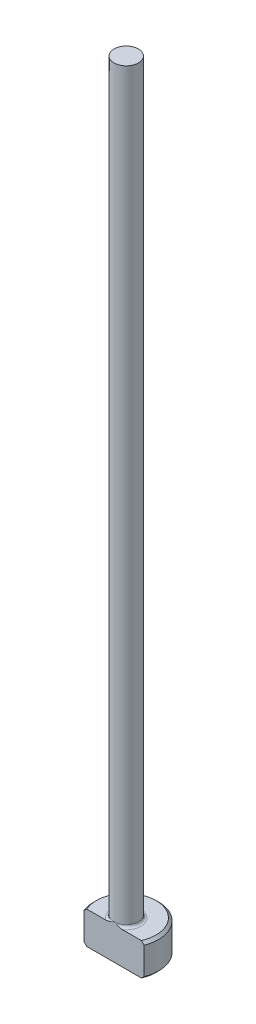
ISO-10303-21;
HEADER;
FILE_DESCRIPTION(('STEP AP214'),'2;1');
FILE_NAME('part.step','',(''),(''),'','','');
FILE_SCHEMA(('AUTOMOTIVE_DESIGN { 1 0 10303 214 1 1 1 1 }'));
ENDSEC;
DATA;
#1=APPLICATION_CONTEXT('core data for automotive mechanical design processes');
#2=APPLICATION_PROTOCOL_DEFINITION('international standard','automotive_design',2000,#1);
#3=PRODUCT_CONTEXT('',#1,'mechanical');
#4=PRODUCT('Part','Part','',(#3));
#5=PRODUCT_RELATED_PRODUCT_CATEGORY('part','',(#4));
#6=PRODUCT_DEFINITION_FORMATION('','',#4);
#7=PRODUCT_DEFINITION_CONTEXT('part definition',#1,'design');
#8=PRODUCT_DEFINITION('design','',#6,#7);
#9=PRODUCT_DEFINITION_SHAPE('','',#8);
#10=(LENGTH_UNIT() NAMED_UNIT(*) SI_UNIT(.MILLI.,.METRE.));
#11=(NAMED_UNIT(*) PLANE_ANGLE_UNIT() SI_UNIT($,.RADIAN.));
#12=(NAMED_UNIT(*) SI_UNIT($,.STERADIAN.) SOLID_ANGLE_UNIT());
#13=UNCERTAINTY_MEASURE_WITH_UNIT(LENGTH_MEASURE(1.E-05),#10,'distance_accuracy_value','');
#14=(GEOMETRIC_REPRESENTATION_CONTEXT(3) GLOBAL_UNCERTAINTY_ASSIGNED_CONTEXT((#13)) GLOBAL_UNIT_ASSIGNED_CONTEXT((#10,
#11,#12)) REPRESENTATION_CONTEXT('',''));
#15=CARTESIAN_POINT('',(0.,0.,0.));
#16=DIRECTION('',(0.,0.,1.));
#17=DIRECTION('',(1.,0.,0.));
#18=AXIS2_PLACEMENT_3D('',#15,#16,#17);
#19=CARTESIAN_POINT('',(0.,0.,0.));
#20=DIRECTION('',(0.,-1.,0.));
#21=DIRECTION('',(0.,0.,-1.));
#22=AXIS2_PLACEMENT_3D('',#19,#20,#21);
#23=PLANE('',#22);
#24=CARTESIAN_POINT('',(0.,0.,0.));
#25=DIRECTION('',(0.,-1.,0.));
#26=DIRECTION('',(0.,0.,-1.));
#27=AXIS2_PLACEMENT_3D('',#24,#25,#26);
#28=CIRCLE('',#27,2.92099999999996);
#29=CARTESIAN_POINT('',(-2.66761406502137,0.,1.18998999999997));
#30=VERTEX_POINT('',#29);
#31=CARTESIAN_POINT('',(2.66761406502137,0.,1.18998999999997));
#32=VERTEX_POINT('',#31);
#33=EDGE_CURVE('E98',#30,#32,#28,.T.);
#34=ORIENTED_EDGE('',*,*,#33,.T.);
#35=DIRECTION('',(-1.,0.,0.));
#36=VECTOR('',#35,1.);
#37=CARTESIAN_POINT('',(-2.94356056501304,0.,1.18998999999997));
#38=LINE('',#37,#36);
#39=EDGE_CURVE('E83',#32,#30,#38,.T.);
#40=ORIENTED_EDGE('',*,*,#39,.T.);
#41=EDGE_LOOP('',(#34,#40));
#42=FACE_BOUND('',#41,.T.);
#43=ADVANCED_FACE('F32',(#42),#23,.T.);
#44=CARTESIAN_POINT('',(0.,259.958771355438,0.));
#45=DIRECTION('',(0.,1.,0.));
#46=DIRECTION('',(0.,0.,1.));
#47=AXIS2_PLACEMENT_3D('',#44,#45,#46);
#48=CYLINDRICAL_SURFACE('',#47,3.17499999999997);
#49=CARTESIAN_POINT('',(0.,2.92099999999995,0.));
#50=DIRECTION('',(0.,1.,0.));
#51=DIRECTION('',(0.,0.,1.));
#52=AXIS2_PLACEMENT_3D('',#49,#50,#51);
#53=CIRCLE('',#52,3.17499999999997);
#54=CARTESIAN_POINT('',(-2.94356056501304,2.92099999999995,1.18998999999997));
#55=VERTEX_POINT('',#54);
#56=CARTESIAN_POINT('',(2.94356056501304,2.92099999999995,1.18998999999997));
#57=VERTEX_POINT('',#56);
#58=EDGE_CURVE('E104',#55,#57,#53,.F.);
#59=ORIENTED_EDGE('',*,*,#58,.T.);
#60=DIRECTION('',(0.,-1.,0.));
#61=VECTOR('',#60,1.);
#62=CARTESIAN_POINT('',(2.94356056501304,76.2,1.18998999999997));
#63=LINE('',#62,#61);
#64=CARTESIAN_POINT('',(2.94356056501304,0.254000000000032,1.18998999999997));
#65=VERTEX_POINT('',#64);
#66=EDGE_CURVE('E183',#57,#65,#63,.T.);
#67=ORIENTED_EDGE('',*,*,#66,.T.);
#68=CARTESIAN_POINT('',(0.,0.254000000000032,0.));
#69=DIRECTION('',(0.,-1.,0.));
#70=DIRECTION('',(0.,0.,-1.));
#71=AXIS2_PLACEMENT_3D('',#68,#69,#70);
#72=CIRCLE('',#71,3.17499999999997);
#73=CARTESIAN_POINT('',(-2.94356056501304,0.254000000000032,1.18998999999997));
#74=VERTEX_POINT('',#73);
#75=EDGE_CURVE('E100',#65,#74,#72,.F.);
#76=ORIENTED_EDGE('',*,*,#75,.T.);
#77=DIRECTION('',(0.,-1.,0.));
#78=VECTOR('',#77,1.);
#79=CARTESIAN_POINT('',(-2.94356056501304,76.2,1.18998999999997));
#80=LINE('',#79,#78);
#81=EDGE_CURVE('E93',#55,#74,#80,.T.);
#82=ORIENTED_EDGE('',*,*,#81,.F.);
#83=EDGE_LOOP('',(#59,#67,#76,#82));
#84=FACE_BOUND('',#83,.T.);
#85=ADVANCED_FACE('F158',(#84),#48,.T.);
#86=CARTESIAN_POINT('',(-3.17499999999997,3.175,0.));
#87=DIRECTION('',(0.,1.,0.));
#88=DIRECTION('',(0.,0.,1.));
#89=AXIS2_PLACEMENT_3D('',#86,#87,#88);
#90=PLANE('',#89);
#91=CARTESIAN_POINT('',(0.,3.175,0.));
#92=DIRECTION('',(0.,1.,0.));
#93=DIRECTION('',(0.,0.,1.));
#94=AXIS2_PLACEMENT_3D('',#91,#92,#93);
#95=CIRCLE('',#94,2.92099999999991);
#96=CARTESIAN_POINT('',(2.66761406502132,3.175,1.18998999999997));
#97=VERTEX_POINT('',#96);
#98=CARTESIAN_POINT('',(-2.66761406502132,3.175,1.18998999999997));
#99=VERTEX_POINT('',#98);
#100=EDGE_CURVE('E178',#97,#99,#95,.T.);
#101=ORIENTED_EDGE('',*,*,#100,.T.);
#102=DIRECTION('',(1.,0.,0.));
#103=VECTOR('',#102,1.);
#104=CARTESIAN_POINT('',(-3.17499999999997,3.175,1.18998999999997));
#105=LINE('',#104,#103);
#106=CARTESIAN_POINT('',(-0.817943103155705,3.17500000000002,1.18998999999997));
#107=VERTEX_POINT('',#106);
#108=EDGE_CURVE('E57',#99,#107,#105,.T.);
#109=ORIENTED_EDGE('',*,*,#108,.T.);
#110=CARTESIAN_POINT('',(0.,3.175,0.));
#111=DIRECTION('',(0.,1.,0.));
#112=DIRECTION('',(0.,0.,1.));
#113=AXIS2_PLACEMENT_3D('',#110,#111,#112);
#114=CIRCLE('',#113,1.44398999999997);
#115=CARTESIAN_POINT('',(0.817943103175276,3.17500000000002,1.18998999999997));
#116=VERTEX_POINT('',#115);
#117=EDGE_CURVE('E107',#107,#116,#114,.F.);
#118=ORIENTED_EDGE('',*,*,#117,.T.);
#119=EDGE_CURVE('E136',#116,#97,#105,.T.);
#120=ORIENTED_EDGE('',*,*,#119,.T.);
#121=EDGE_LOOP('',(#101,#109,#118,#120));
#122=FACE_BOUND('',#121,.T.);
#123=ADVANCED_FACE('F147',(#122),#90,.T.);
#124=CARTESIAN_POINT('',(0.,3.17499999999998,0.));
#125=DIRECTION('',(0.,-1.,0.));
#126=DIRECTION('',(0.,0.,-1.));
#127=AXIS2_PLACEMENT_3D('',#124,#125,#126);
#128=CONICAL_SURFACE('',#127,2.92099999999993,0.78539816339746);
#129=ORIENTED_EDGE('',*,*,#58,.F.);
#130=CARTESIAN_POINT('',(-6.47931936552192,-0.491689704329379,1.18998999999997));
#131=CARTESIAN_POINT('',(-6.3057518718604,-0.320986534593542,1.18998999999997));
#132=CARTESIAN_POINT('',(-6.13208094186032,-0.150388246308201,1.18998999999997));
#133=CARTESIAN_POINT('',(-5.78425276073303,0.190708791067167,1.18998999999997));
#134=CARTESIAN_POINT('',(-5.61009518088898,0.361207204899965,1.18998999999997));
#135=CARTESIAN_POINT('',(-5.25789988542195,0.70525365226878,1.18998999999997));
#136=CARTESIAN_POINT('',(-5.07985463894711,0.878793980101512,1.18998999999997));
#137=CARTESIAN_POINT('',(-4.72344726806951,1.22514212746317,1.18998999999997));
#138=CARTESIAN_POINT('',(-4.54508573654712,1.39795055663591,1.18998999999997));
#139=CARTESIAN_POINT('',(-4.22178053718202,1.70987820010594,1.18998999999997));
#140=CARTESIAN_POINT('',(-4.07696186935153,1.84912689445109,1.18998999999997));
#141=CARTESIAN_POINT('',(-3.78666752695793,2.1269755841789,1.18998999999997));
#142=CARTESIAN_POINT('',(-3.64119177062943,2.26557549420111,1.18998999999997));
#143=CARTESIAN_POINT('',(-3.34872942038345,2.54243487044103,1.18998999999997));
#144=CARTESIAN_POINT('',(-3.20173902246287,2.68069032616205,1.18998999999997));
#145=CARTESIAN_POINT('',(-2.90653907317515,2.95574973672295,1.18998999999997));
#146=CARTESIAN_POINT('',(-2.75833015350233,3.09255436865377,1.18998999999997));
#147=CARTESIAN_POINT('',(-2.4625615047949,3.36167470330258,1.18998999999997));
#148=CARTESIAN_POINT('',(-2.31503539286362,3.49402709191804,1.18998999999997));
#149=CARTESIAN_POINT('',(-2.09131974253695,3.6900852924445,1.18998999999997));
#150=CARTESIAN_POINT('',(-2.01626900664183,3.75508852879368,1.18998999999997));
#151=CARTESIAN_POINT('',(-1.8651664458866,3.88390741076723,1.18998999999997));
#152=CARTESIAN_POINT('',(-1.78911473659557,3.947723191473,1.18998999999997));
#153=CARTESIAN_POINT('',(-1.636284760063,4.07322581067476,1.18998999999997));
#154=CARTESIAN_POINT('',(-1.55951715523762,4.13492558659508,1.18998999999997));
#155=CARTESIAN_POINT('',(-1.40419805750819,4.2560334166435,1.18998999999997));
#156=CARTESIAN_POINT('',(-1.32564684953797,4.31544183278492,1.18998999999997));
#157=CARTESIAN_POINT('',(-1.16630337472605,4.43067355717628,1.18998999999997));
#158=CARTESIAN_POINT('',(-1.08551855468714,4.48650710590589,1.18998999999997));
#159=CARTESIAN_POINT('',(-0.920537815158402,4.59284659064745,1.18998999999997));
#160=CARTESIAN_POINT('',(-0.836346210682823,4.64335899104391,1.18998999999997));
#161=CARTESIAN_POINT('',(-0.730888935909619,4.69956746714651,1.18998999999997));
#162=CARTESIAN_POINT('',(-0.711848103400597,4.7094463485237,1.18998999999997));
#163=CARTESIAN_POINT('',(-0.673521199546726,4.72872851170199,1.18998999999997));
#164=CARTESIAN_POINT('',(-0.654235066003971,4.73813166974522,1.18998999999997));
#165=CARTESIAN_POINT('',(-0.595999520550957,4.76554209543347,1.18998999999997));
#166=CARTESIAN_POINT('',(-0.556668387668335,4.78275278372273,1.18998999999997));
#167=CARTESIAN_POINT('',(-0.477355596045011,4.81434640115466,1.18998999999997));
#168=CARTESIAN_POINT('',(-0.437385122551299,4.8287571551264,1.18998999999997));
#169=CARTESIAN_POINT('',(-0.356410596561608,4.85437528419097,1.18998999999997));
#170=CARTESIAN_POINT('',(-0.315406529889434,4.86558261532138,1.18998999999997));
#171=CARTESIAN_POINT('',(-0.239749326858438,4.8825570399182,1.18998999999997));
#172=CARTESIAN_POINT('',(-0.205233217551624,4.88893154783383,1.18998999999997));
#173=CARTESIAN_POINT('',(-0.135794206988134,4.89877967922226,1.18998999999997));
#174=CARTESIAN_POINT('',(-0.100871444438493,4.90225426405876,1.18998999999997));
#175=CARTESIAN_POINT('',(-0.0309424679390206,4.9061183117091,1.18998999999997));
#176=CARTESIAN_POINT('',(0.00406330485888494,4.90651563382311,1.18998999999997));
#177=CARTESIAN_POINT('',(0.0739860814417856,4.90422492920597,1.18998999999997));
#178=CARTESIAN_POINT('',(0.108903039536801,4.90153554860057,1.18998999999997));
#179=CARTESIAN_POINT('',(0.18581169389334,4.89231772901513,1.18998999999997));
#180=CARTESIAN_POINT('',(0.227719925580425,4.88509144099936,1.18998999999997));
#181=CARTESIAN_POINT('',(0.310690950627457,4.86678744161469,1.18998999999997));
#182=CARTESIAN_POINT('',(0.351753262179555,4.85570759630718,1.18998999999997));
#183=CARTESIAN_POINT('',(0.43313093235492,4.83023017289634,1.18998999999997));
#184=CARTESIAN_POINT('',(0.473439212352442,4.81581030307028,1.18998999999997));
#185=CARTESIAN_POINT('',(0.552977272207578,4.78431092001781,1.18998999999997));
#186=CARTESIAN_POINT('',(0.592207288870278,4.76723199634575,1.18998999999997));
#187=CARTESIAN_POINT('',(0.705140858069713,4.7143405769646,1.18998999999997));
#188=CARTESIAN_POINT('',(0.777512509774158,4.67569611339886,1.18998999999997));
#189=CARTESIAN_POINT('',(0.919347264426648,4.59335368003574,1.18998999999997));
#190=CARTESIAN_POINT('',(0.988806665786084,4.54964952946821,1.18998999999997));
#191=CARTESIAN_POINT('',(1.12574256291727,4.45870111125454,1.18998999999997));
#192=CARTESIAN_POINT('',(1.19321018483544,4.41144359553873,1.18998999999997));
#193=CARTESIAN_POINT('',(1.32639871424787,4.31461731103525,1.18998999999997));
#194=CARTESIAN_POINT('',(1.39212046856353,4.26504969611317,1.18998999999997));
#195=CARTESIAN_POINT('',(1.52321682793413,4.1635082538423,1.18998999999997));
#196=CARTESIAN_POINT('',(1.58857229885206,4.11150983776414,1.18998999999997));
#197=CARTESIAN_POINT('',(1.7182626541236,4.00624640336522,1.18998999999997));
#198=CARTESIAN_POINT('',(1.78259742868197,3.95298125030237,1.18998999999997));
#199=CARTESIAN_POINT('',(1.91030466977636,3.84563387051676,1.18998999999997));
#200=CARTESIAN_POINT('',(1.97367914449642,3.79155402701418,1.18998999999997));
#201=CARTESIAN_POINT('',(2.0997915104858,3.68266386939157,1.18998999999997));
#202=CARTESIAN_POINT('',(2.16252942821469,3.62785358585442,1.18998999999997));
#203=CARTESIAN_POINT('',(2.32034022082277,3.48869772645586,1.18998999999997));
#204=CARTESIAN_POINT('',(2.41507621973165,3.40397040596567,1.18998999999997));
#205=CARTESIAN_POINT('',(2.60367921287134,3.2335529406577,1.18998999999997));
#206=CARTESIAN_POINT('',(2.69754618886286,3.14786277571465,1.18998999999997));
#207=CARTESIAN_POINT('',(2.9781859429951,2.88972120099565,1.18998999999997));
#208=CARTESIAN_POINT('',(3.16398386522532,2.71621092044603,1.18998999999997));
#209=CARTESIAN_POINT('',(3.53424564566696,2.36730235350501,1.18998999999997));
#210=CARTESIAN_POINT('',(3.71870746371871,2.19190191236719,1.18998999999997));
#211=CARTESIAN_POINT('',(4.08658256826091,1.84002104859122,1.18998999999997));
#212=CARTESIAN_POINT('',(4.26999589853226,1.66354067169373,1.18998999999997));
#213=CARTESIAN_POINT('',(4.62290911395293,1.32258886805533,1.18998999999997));
#214=CARTESIAN_POINT('',(4.79245879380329,1.1581689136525,1.18998999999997));
#215=CARTESIAN_POINT('',(5.13110594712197,0.828859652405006,1.18998999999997));
#216=CARTESIAN_POINT('',(5.3002034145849,0.663970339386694,1.18998999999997));
#217=CARTESIAN_POINT('',(5.63778854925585,0.334103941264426,1.18998999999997));
#218=CARTESIAN_POINT('',(5.8062767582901,0.169127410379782,1.18998999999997));
#219=CARTESIAN_POINT('',(6.142982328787,-0.161096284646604,1.18998999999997));
#220=CARTESIAN_POINT('',(6.3111996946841,-0.3263434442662,1.18998999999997));
#221=CARTESIAN_POINT('',(6.47931936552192,-0.491689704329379,1.18998999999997));
#222=B_SPLINE_CURVE_WITH_KNOTS('',3,(#130,#131,#132,#133,#134,#135,#136,#137,#138,#139,#140,
#141,#142,#143,#144,#145,#146,#147,#148,#149,#150,#151,#152,#153,#154,#155,#156,#157,#158,#159,
#160,#161,#162,#163,#164,#165,#166,#167,#168,#169,#170,#171,#172,#173,#174,#175,#176,#177,#178,
#179,#180,#181,#182,#183,#184,#185,#186,#187,#188,#189,#190,#191,#192,#193,#194,#195,#196,#197,
#198,#199,#200,#201,#202,#203,#204,#205,#206,#207,#208,#209,#210,#211,#212,#213,#214,#215,#216,
#217,#218,#219,#220,#221),.UNSPECIFIED.,.F.,.F.,(4,2,2,2,2,2,2,2,2,2,2,2,2,2,2,2,2,2,2,2,2,2,2,
2,2,2,2,2,2,2,2,2,2,2,2,2,2,2,2,2,2,2,2,2,2,4),(0.,0.730333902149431,1.46150049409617,
2.20738656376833,2.95242206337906,3.55513421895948,4.15792356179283,4.7632985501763,
5.36837734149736,5.9629222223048,6.26077664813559,6.55859698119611,6.85403741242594,
7.14943097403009,7.44393654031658,7.73808009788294,7.80242723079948,7.86679101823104,
7.99550301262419,8.12286192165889,8.25022257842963,8.35541203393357,8.46056660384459,
8.56545252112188,8.67038446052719,8.79775050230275,8.92518718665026,9.05350023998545,
9.18178488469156,9.42755588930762,9.67363035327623,9.9206726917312,10.1675929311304,
10.4181243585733,10.6686825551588,10.9186125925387,11.1685321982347,11.5498128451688,
11.9311014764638,12.6937337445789,13.4573540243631,14.2209421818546,14.9294812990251,
15.6380297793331,16.3454542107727,17.052866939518),.UNSPECIFIED.);
#223=EDGE_CURVE('E135',#55,#99,#222,.T.);
#224=ORIENTED_EDGE('',*,*,#223,.T.);
#225=ORIENTED_EDGE('',*,*,#100,.F.);
#226=EDGE_CURVE('E127',#97,#57,#222,.T.);
#227=ORIENTED_EDGE('',*,*,#226,.T.);
#228=EDGE_LOOP('',(#129,#224,#225,#227));
#229=FACE_BOUND('',#228,.T.);
#230=ADVANCED_FACE('F143',(#229),#128,.T.);
#231=CARTESIAN_POINT('',(0.,0.254000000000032,0.));
#232=DIRECTION('',(0.,1.,0.));
#233=DIRECTION('',(0.,0.,1.));
#234=AXIS2_PLACEMENT_3D('',#231,#232,#233);
#235=CONICAL_SURFACE('',#234,3.17499999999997,0.785398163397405);
#236=ORIENTED_EDGE('',*,*,#75,.F.);
#237=CARTESIAN_POINT('',(6.47931936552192,3.66668970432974,1.18998999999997));
#238=CARTESIAN_POINT('',(6.30575187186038,3.49598653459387,1.18998999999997));
#239=CARTESIAN_POINT('',(6.13208094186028,3.32538824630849,1.18998999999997));
#240=CARTESIAN_POINT('',(5.78425276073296,2.98429120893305,1.18998999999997));
#241=CARTESIAN_POINT('',(5.6100951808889,2.81379279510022,1.18998999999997));
#242=CARTESIAN_POINT('',(5.25789988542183,2.46974634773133,1.18998999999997));
#243=CARTESIAN_POINT('',(5.07985463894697,2.29620601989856,1.18998999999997));
#244=CARTESIAN_POINT('',(4.72344726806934,1.94985787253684,1.18998999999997));
#245=CARTESIAN_POINT('',(4.54508573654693,1.77704944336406,1.18998999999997));
#246=CARTESIAN_POINT('',(4.22178053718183,1.465121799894,1.18998999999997));
#247=CARTESIAN_POINT('',(4.07696186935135,1.32587310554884,1.18998999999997));
#248=CARTESIAN_POINT('',(3.78666752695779,1.04802441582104,1.18998999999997));
#249=CARTESIAN_POINT('',(3.64119177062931,0.909424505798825,1.18998999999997));
#250=CARTESIAN_POINT('',(3.34872942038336,0.632565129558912,1.18998999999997));
#251=CARTESIAN_POINT('',(3.2017390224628,0.49430967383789,1.18998999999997));
#252=CARTESIAN_POINT('',(2.90653907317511,0.219250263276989,1.18998999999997));
#253=CARTESIAN_POINT('',(2.75833015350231,0.0824456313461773,1.18998999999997));
#254=CARTESIAN_POINT('',(2.46256150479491,-0.186674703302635,1.18998999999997));
#255=CARTESIAN_POINT('',(2.31503539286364,-0.319027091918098,1.18998999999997));
#256=CARTESIAN_POINT('',(2.09131974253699,-0.51508529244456,1.18998999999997));
#257=CARTESIAN_POINT('',(2.01626900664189,-0.580088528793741,1.18998999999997));
#258=CARTESIAN_POINT('',(1.86516644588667,-0.708907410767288,1.18998999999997));
#259=CARTESIAN_POINT('',(1.78911473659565,-0.772723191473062,1.18998999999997));
#260=CARTESIAN_POINT('',(1.6362847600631,-0.898225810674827,1.18998999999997));
#261=CARTESIAN_POINT('',(1.55951715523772,-0.959925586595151,1.18998999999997));
#262=CARTESIAN_POINT('',(1.40419805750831,-1.08103341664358,1.18998999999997));
#263=CARTESIAN_POINT('',(1.3256468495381,-1.140441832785,1.18998999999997));
#264=CARTESIAN_POINT('',(1.1663033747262,-1.25567355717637,1.18998999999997));
#265=CARTESIAN_POINT('',(1.08551855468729,-1.31150710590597,1.18998999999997));
#266=CARTESIAN_POINT('',(0.920537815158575,-1.41784659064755,1.18998999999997));
#267=CARTESIAN_POINT('',(0.836346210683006,-1.46835899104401,1.18998999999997));
#268=CARTESIAN_POINT('',(0.730888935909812,-1.52456746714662,1.18998999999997));
#269=CARTESIAN_POINT('',(0.711848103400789,-1.53444634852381,1.18998999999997));
#270=CARTESIAN_POINT('',(0.673521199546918,-1.55372851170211,1.18998999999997));
#271=CARTESIAN_POINT('',(0.654235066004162,-1.56313166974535,1.18998999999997));
#272=CARTESIAN_POINT('',(0.595999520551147,-1.59054209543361,1.18998999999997));
#273=CARTESIAN_POINT('',(0.556668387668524,-1.60775278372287,1.18998999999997));
#274=CARTESIAN_POINT('',(0.477355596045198,-1.63934640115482,1.18998999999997));
#275=CARTESIAN_POINT('',(0.437385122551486,-1.65375715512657,1.18998999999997));
#276=CARTESIAN_POINT('',(0.356410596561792,-1.67937528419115,1.18998999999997));
#277=CARTESIAN_POINT('',(0.315406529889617,-1.69058261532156,1.18998999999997));
#278=CARTESIAN_POINT('',(0.239749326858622,-1.7075570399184,1.18998999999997));
#279=CARTESIAN_POINT('',(0.205233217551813,-1.71393154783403,1.18998999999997));
#280=CARTESIAN_POINT('',(0.135794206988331,-1.72377967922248,1.18998999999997));
#281=CARTESIAN_POINT('',(0.100871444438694,-1.72725426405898,1.18998999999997));
#282=CARTESIAN_POINT('',(0.0309424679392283,-1.73111831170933,1.18998999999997));
#283=CARTESIAN_POINT('',(-0.00406330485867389,-1.73151563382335,1.18998999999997));
#284=CARTESIAN_POINT('',(-0.0739860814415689,-1.72922492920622,1.18998999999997));
#285=CARTESIAN_POINT('',(-0.108903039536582,-1.72653554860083,1.18998999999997));
#286=CARTESIAN_POINT('',(-0.185811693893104,-1.7173177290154,1.18998999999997));
#287=CARTESIAN_POINT('',(-0.227719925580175,-1.71009144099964,1.18998999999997));
#288=CARTESIAN_POINT('',(-0.310690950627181,-1.69178744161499,1.18998999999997));
#289=CARTESIAN_POINT('',(-0.351753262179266,-1.68070759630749,1.18998999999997));
#290=CARTESIAN_POINT('',(-0.433130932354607,-1.65523017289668,1.18998999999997));
#291=CARTESIAN_POINT('',(-0.473439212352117,-1.64081030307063,1.18998999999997));
#292=CARTESIAN_POINT('',(-0.55297727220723,-1.60931092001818,1.18998999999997));
#293=CARTESIAN_POINT('',(-0.592207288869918,-1.59223199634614,1.18998999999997));
#294=CARTESIAN_POINT('',(-0.705140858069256,-1.53934057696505,1.18998999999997));
#295=CARTESIAN_POINT('',(-0.77751250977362,-1.50069611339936,1.18998999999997));
#296=CARTESIAN_POINT('',(-0.919347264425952,-1.41835368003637,1.18998999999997));
#297=CARTESIAN_POINT('',(-0.988806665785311,-1.3746495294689,1.18998999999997));
#298=CARTESIAN_POINT('',(-1.12574256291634,-1.28370111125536,1.18998999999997));
#299=CARTESIAN_POINT('',(-1.19321018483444,-1.23644359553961,1.18998999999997));
#300=CARTESIAN_POINT('',(-1.32639871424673,-1.13961731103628,1.18998999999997));
#301=CARTESIAN_POINT('',(-1.39212046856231,-1.09004969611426,1.18998999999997));
#302=CARTESIAN_POINT('',(-1.52321682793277,-0.988508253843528,1.18998999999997));
#303=CARTESIAN_POINT('',(-1.58857229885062,-0.936509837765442,1.18998999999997));
#304=CARTESIAN_POINT('',(-1.71826265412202,-0.83124640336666,1.18998999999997));
#305=CARTESIAN_POINT('',(-1.78259742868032,-0.777981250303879,1.18998999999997));
#306=CARTESIAN_POINT('',(-1.91030466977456,-0.6706338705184,1.18998999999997));
#307=CARTESIAN_POINT('',(-1.97367914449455,-0.616554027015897,1.18998999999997));
#308=CARTESIAN_POINT('',(-2.09979151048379,-0.507663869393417,1.18998999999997));
#309=CARTESIAN_POINT('',(-2.16252942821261,-0.45285358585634,1.18998999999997));
#310=CARTESIAN_POINT('',(-2.32034022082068,-0.313697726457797,1.18998999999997));
#311=CARTESIAN_POINT('',(-2.41507621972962,-0.228970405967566,1.18998999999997));
#312=CARTESIAN_POINT('',(-2.60367921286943,-0.0585529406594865,1.18998999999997));
#313=CARTESIAN_POINT('',(-2.69754618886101,0.0271372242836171,1.18998999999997));
#314=CARTESIAN_POINT('',(-2.97818594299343,0.285278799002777,1.18998999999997));
#315=CARTESIAN_POINT('',(-3.16398386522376,0.45878907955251,1.18998999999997));
#316=CARTESIAN_POINT('',(-3.53424564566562,0.807697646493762,1.18998999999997));
#317=CARTESIAN_POINT('',(-3.71870746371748,0.983098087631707,1.18998999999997));
#318=CARTESIAN_POINT('',(-4.08658256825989,1.33497895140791,1.18998999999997));
#319=CARTESIAN_POINT('',(-4.26999589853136,1.51145932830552,1.18998999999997));
#320=CARTESIAN_POINT('',(-4.6229091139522,1.85241113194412,1.18998999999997));
#321=CARTESIAN_POINT('',(-4.79245879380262,2.01683108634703,1.18998999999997));
#322=CARTESIAN_POINT('',(-5.13110594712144,2.34614034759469,1.18998999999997));
#323=CARTESIAN_POINT('',(-5.30020341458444,2.51102966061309,1.18998999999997));
#324=CARTESIAN_POINT('',(-5.63778854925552,2.84089605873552,1.18998999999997));
#325=CARTESIAN_POINT('',(-5.80627675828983,3.00587258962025,1.18998999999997));
#326=CARTESIAN_POINT('',(-6.14298232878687,3.3360962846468,1.18998999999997));
#327=CARTESIAN_POINT('',(-6.31119969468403,3.50134344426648,1.18998999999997));
#328=CARTESIAN_POINT('',(-6.47931936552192,3.66668970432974,1.18998999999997));
#329=B_SPLINE_CURVE_WITH_KNOTS('',3,(#237,#238,#239,#240,#241,#242,#243,#244,#245,#246,#247,
#248,#249,#250,#251,#252,#253,#254,#255,#256,#257,#258,#259,#260,#261,#262,#263,#264,#265,#266,
#267,#268,#269,#270,#271,#272,#273,#274,#275,#276,#277,#278,#279,#280,#281,#282,#283,#284,#285,
#286,#287,#288,#289,#290,#291,#292,#293,#294,#295,#296,#297,#298,#299,#300,#301,#302,#303,#304,
#305,#306,#307,#308,#309,#310,#311,#312,#313,#314,#315,#316,#317,#318,#319,#320,#321,#322,#323,
#324,#325,#326,#327,#328),.UNSPECIFIED.,.F.,.F.,(4,2,2,2,2,2,2,2,2,2,2,2,2,2,2,2,2,2,2,2,2,2,2,
2,2,2,2,2,2,2,2,2,2,2,2,2,2,2,2,2,2,2,2,2,2,4),(0.,0.730333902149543,1.4615004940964,
2.20738656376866,2.95242206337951,3.55513421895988,4.15792356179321,4.76329855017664,
5.36837734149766,5.96292222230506,6.26077664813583,6.55859698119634,6.85403741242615,
7.14943097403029,7.44393654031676,7.73808009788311,7.80242723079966,7.86679101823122,
7.99550301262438,8.12286192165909,8.25022257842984,8.35541203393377,8.46056660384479,
8.56545252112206,8.67038446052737,8.79775050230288,8.92518718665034,9.05350023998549,
9.18178488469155,9.42755588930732,9.67363035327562,9.9206726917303,10.1675929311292,
10.4181243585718,10.668682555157,10.9186125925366,11.1685321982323,11.5498128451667,
11.9311014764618,12.6937337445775,13.4573540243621,14.2209421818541,14.9294812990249,
15.6380297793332,16.3454542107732,17.0528669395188),.UNSPECIFIED.);
#330=EDGE_CURVE('E86',#65,#32,#329,.T.);
#331=ORIENTED_EDGE('',*,*,#330,.T.);
#332=ORIENTED_EDGE('',*,*,#33,.F.);
#333=EDGE_CURVE('E89',#30,#74,#329,.T.);
#334=ORIENTED_EDGE('',*,*,#333,.T.);
#335=EDGE_LOOP('',(#236,#331,#332,#334));
#336=FACE_BOUND('',#335,.T.);
#337=ADVANCED_FACE('F97',(#336),#235,.T.);
#338=CARTESIAN_POINT('',(0.,3.42900000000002,0.));
#339=DIRECTION('',(0.,1.,0.));
#340=DIRECTION('',(0.,0.,1.));
#341=AXIS2_PLACEMENT_3D('',#338,#339,#340);
#342=TOROIDAL_SURFACE('',#341,1.44398999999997,0.254);
#343=CARTESIAN_POINT('',(0.,3.42900000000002,1.18998999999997));
#344=CARTESIAN_POINT('',(1.26788799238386E-12,3.42900058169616,1.18998999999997));
#345=CARTESIAN_POINT('',(1.02037080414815E-07,3.42900116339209,1.18998999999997));
#346=CARTESIAN_POINT('',(4.36423738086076E-07,3.42900229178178,1.18998999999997));
#347=CARTESIAN_POINT('',(6.7104077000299E-07,3.42900283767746,1.18998999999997));
#348=CARTESIAN_POINT('',(1.23856841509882E-06,3.42900392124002,1.18998999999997));
#349=CARTESIAN_POINT('',(1.57695860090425E-06,3.42900445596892,1.18998999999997));
#350=CARTESIAN_POINT('',(2.31458772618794E-06,3.42900547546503,1.18998999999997));
#351=CARTESIAN_POINT('',(2.71349856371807E-06,3.42900596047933,1.18998999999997));
#352=CARTESIAN_POINT('',(4.11884078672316E-06,3.42900754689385,1.18998999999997));
#353=CARTESIAN_POINT('',(5.20568846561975E-06,3.42900857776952,1.18998999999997));
#354=CARTESIAN_POINT('',(7.47790847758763E-06,3.4290104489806,1.18998999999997));
#355=CARTESIAN_POINT('',(8.65996322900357E-06,3.4290112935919,1.18998999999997));
#356=CARTESIAN_POINT('',(1.31663854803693E-05,3.42901436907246,1.18998999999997));
#357=CARTESIAN_POINT('',(1.6609768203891E-05,3.42901643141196,1.18998999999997));
#358=CARTESIAN_POINT('',(2.34843039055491E-05,3.42901989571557,1.18998999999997));
#359=CARTESIAN_POINT('',(2.68971573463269E-05,3.42902133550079,1.18998999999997));
#360=CARTESIAN_POINT('',(4.11260389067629E-05,3.42902727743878,1.18998999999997));
#361=CARTESIAN_POINT('',(5.19833878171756E-05,3.42903166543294,1.18998999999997));
#362=CARTESIAN_POINT('',(7.24910575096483E-05,3.42903888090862,1.18998999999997));
#363=CARTESIAN_POINT('',(8.20928106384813E-05,3.42904184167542,1.18998999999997));
#364=CARTESIAN_POINT('',(0.000150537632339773,3.42906480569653,1.18998999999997));
#365=CARTESIAN_POINT('',(0.000206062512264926,3.42909344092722,1.18998999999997));
#366=CARTESIAN_POINT('',(0.000420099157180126,3.42919967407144,1.18998999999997));
#367=CARTESIAN_POINT('',(0.000580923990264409,3.42927086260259,1.18998999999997));
#368=CARTESIAN_POINT('',(0.0011986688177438,3.42954850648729,1.18998999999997));
#369=CARTESIAN_POINT('',(0.00165320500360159,3.42976167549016,1.18998999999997));
#370=CARTESIAN_POINT('',(0.00349115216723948,3.43061934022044,1.18998999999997));
#371=CARTESIAN_POINT('',(0.00487719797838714,3.43125630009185,1.18998999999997));
#372=CARTESIAN_POINT('',(0.0272455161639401,3.44154091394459,1.18998999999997));
#373=CARTESIAN_POINT('',(0.0482060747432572,3.45125229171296,1.18998999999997));
#374=CARTESIAN_POINT('',(0.0894544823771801,3.47019581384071,1.18998999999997));
#375=CARTESIAN_POINT('',(0.109740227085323,3.47943284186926,1.18998999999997));
#376=CARTESIAN_POINT('',(0.152645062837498,3.49874471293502,1.18998999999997));
#377=CARTESIAN_POINT('',(0.17527359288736,3.50879895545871,1.18998999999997));
#378=CARTESIAN_POINT('',(0.220904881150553,3.52864652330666,1.18998999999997));
#379=CARTESIAN_POINT('',(0.243909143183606,3.53843639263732,1.18998999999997));
#380=CARTESIAN_POINT('',(0.301812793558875,3.56234769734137,1.18998999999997));
#381=CARTESIAN_POINT('',(0.336843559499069,3.57615550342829,1.18998999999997));
#382=CARTESIAN_POINT('',(0.406753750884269,3.60184766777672,1.18998999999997));
#383=CARTESIAN_POINT('',(0.441620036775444,3.61376719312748,1.18998999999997));
#384=CARTESIAN_POINT('',(0.50021476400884,3.63181866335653,1.18998999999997));
#385=CARTESIAN_POINT('',(0.523756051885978,3.63855079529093,1.18998999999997));
#386=CARTESIAN_POINT('',(0.571256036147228,3.65089320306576,1.18998999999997));
#387=CARTESIAN_POINT('',(0.595216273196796,3.65649741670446,1.18998999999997));
#388=CARTESIAN_POINT('',(0.669974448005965,3.6717221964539,1.18998999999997));
#389=CARTESIAN_POINT('',(0.721326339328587,3.67898748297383,1.18998999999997));
#390=CARTESIAN_POINT('',(0.80486783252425,3.68348474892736,1.18998999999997));
#391=CARTESIAN_POINT('',(0.836903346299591,3.6834849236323,1.18998999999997));
#392=CARTESIAN_POINT('',(0.900349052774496,3.67912359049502,1.18998999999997));
#393=CARTESIAN_POINT('',(0.931762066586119,3.67481634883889,1.18998999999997));
#394=CARTESIAN_POINT('',(0.98360843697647,3.66299454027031,1.18998999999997));
#395=CARTESIAN_POINT('',(1.00436819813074,3.65692785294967,1.18998999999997));
#396=CARTESIAN_POINT('',(1.04483432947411,3.64179163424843,1.18998999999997));
#397=CARTESIAN_POINT('',(1.06453980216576,3.63271959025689,1.18998999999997));
#398=CARTESIAN_POINT('',(1.09672199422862,3.61416783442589,1.18998999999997));
#399=CARTESIAN_POINT('',(1.10967469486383,3.60551806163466,1.18998999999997));
#400=CARTESIAN_POINT('',(1.13407930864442,3.58631142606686,1.18998999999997));
#401=CARTESIAN_POINT('',(1.1455339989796,3.57575818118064,1.18998999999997));
#402=CARTESIAN_POINT('',(1.16408929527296,3.555205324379,1.18998999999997));
#403=CARTESIAN_POINT('',(1.17159652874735,3.54557455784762,1.18998999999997));
#404=CARTESIAN_POINT('',(1.18494613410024,3.52520962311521,1.18998999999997));
#405=CARTESIAN_POINT('',(1.19078913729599,3.51447587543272,1.18998999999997));
#406=CARTESIAN_POINT('',(1.20047872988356,3.4920216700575,1.18998999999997));
#407=CARTESIAN_POINT('',(1.20430808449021,3.48029366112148,1.18998999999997));
#408=CARTESIAN_POINT('',(1.20958011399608,3.45631266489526,1.18998999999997));
#409=CARTESIAN_POINT('',(1.2110249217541,3.44406015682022,1.18998999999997));
#410=CARTESIAN_POINT('',(1.21137893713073,3.42120864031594,1.18998999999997));
#411=CARTESIAN_POINT('',(1.21060887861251,3.41061344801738,1.18998999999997));
#412=CARTESIAN_POINT('',(1.20725809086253,3.3897162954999,1.18998999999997));
#413=CARTESIAN_POINT('',(1.20467751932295,3.37941430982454,1.18998999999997));
#414=CARTESIAN_POINT('',(1.19793821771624,3.35957884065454,1.18998999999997));
#415=CARTESIAN_POINT('',(1.19381228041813,3.35003406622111,1.18998999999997));
#416=CARTESIAN_POINT('',(1.18419596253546,3.33166440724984,1.18998999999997));
#417=CARTESIAN_POINT('',(1.17870510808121,3.32283977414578,1.18998999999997));
#418=CARTESIAN_POINT('',(1.16411880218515,3.30258488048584,1.18998999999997));
#419=CARTESIAN_POINT('',(1.15446574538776,3.29155545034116,1.18998999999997));
#420=CARTESIAN_POINT('',(1.13349747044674,3.27120205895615,1.18998999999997));
#421=CARTESIAN_POINT('',(1.12217832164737,3.26188225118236,1.18998999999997));
#422=CARTESIAN_POINT('',(1.09350772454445,3.24144295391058,1.18998999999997));
#423=CARTESIAN_POINT('',(1.07557783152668,3.23113789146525,1.18998999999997));
#424=CARTESIAN_POINT('',(1.03838039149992,3.21349111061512,1.18998999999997));
#425=CARTESIAN_POINT('',(1.01911345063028,3.20614805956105,1.18998999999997));
#426=CARTESIAN_POINT('',(0.968966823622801,3.19064433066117,1.18998999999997));
#427=CARTESIAN_POINT('',(0.93754078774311,3.1842646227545,1.18998999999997));
#428=CARTESIAN_POINT('',(0.873763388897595,3.17625798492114,1.18998999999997));
#429=CARTESIAN_POINT('',(0.841405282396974,3.17469515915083,1.18998999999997));
#430=CARTESIAN_POINT('',(0.750100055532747,3.17569533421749,1.18998999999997));
#431=CARTESIAN_POINT('',(0.691210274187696,3.18271821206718,1.18998999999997));
#432=CARTESIAN_POINT('',(0.605738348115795,3.19911877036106,1.18998999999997));
#433=CARTESIAN_POINT('',(0.578411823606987,3.2053292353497,1.18998999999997));
#434=CARTESIAN_POINT('',(0.524295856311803,3.21923824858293,1.18998999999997));
#435=CARTESIAN_POINT('',(0.497504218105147,3.22692795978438,1.18998999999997));
#436=CARTESIAN_POINT('',(0.436219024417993,3.24603766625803,1.18998999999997));
#437=CARTESIAN_POINT('',(0.401860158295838,3.25788100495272,1.18998999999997));
#438=CARTESIAN_POINT('',(0.332941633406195,3.28335943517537,1.18998999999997));
#439=CARTESIAN_POINT('',(0.298394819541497,3.29702881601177,1.18998999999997));
#440=CARTESIAN_POINT('',(0.24123279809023,3.32069469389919,1.18998999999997));
#441=CARTESIAN_POINT('',(0.218491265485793,3.3303906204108,1.18998999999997));
#442=CARTESIAN_POINT('',(0.173377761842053,3.3500392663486,1.18998999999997));
#443=CARTESIAN_POINT('',(0.151004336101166,3.35998864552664,1.18998999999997));
#444=CARTESIAN_POINT('',(0.108581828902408,3.37909394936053,1.18998999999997));
#445=CARTESIAN_POINT('',(0.0885236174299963,3.38822996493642,1.18998999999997));
#446=CARTESIAN_POINT('',(0.0477371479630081,3.40696407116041,1.18998999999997));
#447=CARTESIAN_POINT('',(0.0270109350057,3.41656691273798,1.18998999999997));
#448=CARTESIAN_POINT('',(0.00487721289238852,3.42674369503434,1.18998999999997));
#449=CARTESIAN_POINT('',(0.00349118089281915,3.42738064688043,1.18998999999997));
#450=CARTESIAN_POINT('',(0.00165323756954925,3.42823830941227,1.18998999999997));
#451=CARTESIAN_POINT('',(0.00119869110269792,3.42845148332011,1.18998999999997));
#452=CARTESIAN_POINT('',(0.000580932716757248,3.42872913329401,1.18998999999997));
#453=CARTESIAN_POINT('',(0.000420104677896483,3.42880032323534,1.18998999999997));
#454=CARTESIAN_POINT('',(0.000206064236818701,3.42890655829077,1.18998999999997));
#455=CARTESIAN_POINT('',(0.000150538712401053,3.42893519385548,1.18998999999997));
#456=CARTESIAN_POINT('',(8.20931380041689E-05,3.42895815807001,1.18998999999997));
#457=CARTESIAN_POINT('',(7.24913302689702E-05,3.42896111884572,1.18998999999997));
#458=CARTESIAN_POINT('',(5.19835428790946E-05,3.42896833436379,1.18998999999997));
#459=CARTESIAN_POINT('',(4.11261323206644E-05,3.42897272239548,1.18998999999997));
#460=CARTESIAN_POINT('',(2.6897181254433E-05,3.42897866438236,1.18998999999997));
#461=CARTESIAN_POINT('',(2.34843186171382E-05,3.42898010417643,1.18998999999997));
#462=CARTESIAN_POINT('',(1.66097659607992E-05,3.42898356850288,1.18998999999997));
#463=CARTESIAN_POINT('',(1.31663757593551E-05,3.42898563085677,1.18998999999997));
#464=CARTESIAN_POINT('',(8.65994663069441E-06,3.42898870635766,1.18998999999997));
#465=CARTESIAN_POINT('',(7.4778910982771E-06,3.42898955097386,1.18998999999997));
#466=CARTESIAN_POINT('',(5.20567052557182E-06,3.42899142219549,1.18998999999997));
#467=CARTESIAN_POINT('',(4.11882310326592E-06,3.42899245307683,1.18998999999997));
#468=CARTESIAN_POINT('',(2.71348243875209E-06,3.42899403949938,1.18998999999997));
#469=CARTESIAN_POINT('',(2.31457228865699E-06,3.42899452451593,1.18998999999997));
#470=CARTESIAN_POINT('',(1.5769449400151E-06,3.42899554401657,1.18998999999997));
#471=CARTESIAN_POINT('',(1.23855584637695E-06,3.42899607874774,1.18998999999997));
#472=CARTESIAN_POINT('',(6.71030864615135E-07,3.4289971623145,1.18998999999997));
#473=CARTESIAN_POINT('',(4.36415361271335E-07,3.42899770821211,1.18998999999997));
#474=CARTESIAN_POINT('',(1.02032397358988E-07,3.42899883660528,1.18998999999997));
#475=CARTESIAN_POINT('',(-1.26789040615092E-12,3.42899941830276,1.18998999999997));
#476=CARTESIAN_POINT('',(0.,3.42900000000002,1.18998999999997));
#477=B_SPLINE_CURVE_WITH_KNOTS('',3,(#343,#344,#345,#346,#347,#348,#349,#350,#351,#352,#353,
#354,#355,#356,#357,#358,#359,#360,#361,#362,#363,#364,#365,#366,#367,#368,#369,#370,#371,#372,
#373,#374,#375,#376,#377,#378,#379,#380,#381,#382,#383,#384,#385,#386,#387,#388,#389,#390,#391,
#392,#393,#394,#395,#396,#397,#398,#399,#400,#401,#402,#403,#404,#405,#406,#407,#408,#409,#410,
#411,#412,#413,#414,#415,#416,#417,#418,#419,#420,#421,#422,#423,#424,#425,#426,#427,#428,#429,
#430,#431,#432,#433,#434,#435,#436,#437,#438,#439,#440,#441,#442,#443,#444,#445,#446,#447,#448,
#449,#450,#451,#452,#453,#454,#455,#456,#457,#458,#459,#460,#461,#462,#463,#464,#465,#466,#467,
#468,#469,#470,#471,#472,#473,#474,#475,#476),.UNSPECIFIED.,.T.,.F.,(4,2,2,2,2,2,2,2,2,2,2,2,2,
2,2,2,2,2,2,2,2,2,2,2,2,2,2,2,2,2,2,2,2,2,2,2,2,2,2,2,2,2,2,2,2,2,2,2,2,2,2,2,2,2,2,2,2,2,2,2,2,
2,2,2,2,2,4),(0.,1.74334279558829E-06,3.51742687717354E-06,5.40897465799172E-06,
7.29061181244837E-06,1.17623168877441E-05,1.61171458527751E-05,2.81146681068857E-05,
3.92160061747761E-05,7.43362867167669E-05,0.000104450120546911,0.000291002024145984,
0.000819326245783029,0.0023245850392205,0.0069016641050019,0.0761955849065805,0.143066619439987,
0.217348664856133,0.292347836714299,0.405281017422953,0.515769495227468,0.589195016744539,
0.663005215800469,0.817937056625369,0.913834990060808,1.00853980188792,1.07324987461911,
1.13801418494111,1.1845909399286,1.23108008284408,1.26757344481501,1.30405294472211,
1.34083978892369,1.37759371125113,1.40930419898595,1.44101192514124,1.47208177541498,
1.50316242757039,1.54688970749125,1.59072185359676,1.65241699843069,1.71408435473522,
1.80974843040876,1.90668024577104,2.08347049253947,2.1675319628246,2.2511060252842,
2.36008753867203,2.47151858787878,2.54568247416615,2.61913749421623,2.6852617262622,
2.7537809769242,2.75835800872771,2.75986330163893,2.76039163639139,2.76057819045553,
2.76060830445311,2.76064342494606,2.76065452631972,2.76066652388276,2.76067087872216,
2.7606753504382,2.76067723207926,2.760679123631,2.76068089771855,2.76068264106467),.UNSPECIFIED.);
#478=CARTESIAN_POINT('',(0.,3.42900000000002,1.18998999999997));
#479=VERTEX_POINT('',#478);
#480=EDGE_CURVE('E11',#116,#479,#477,.T.);
#481=ORIENTED_EDGE('',*,*,#480,.F.);
#482=ORIENTED_EDGE('',*,*,#117,.F.);
#483=CARTESIAN_POINT('',(0.,3.42900000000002,1.18998999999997));
#484=CARTESIAN_POINT('',(-1.26790485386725E-12,3.42899941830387,1.18998999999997));
#485=CARTESIAN_POINT('',(-1.02037080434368E-07,3.42899883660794,1.18998999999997));
#486=CARTESIAN_POINT('',(-4.36423738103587E-07,3.42899770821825,1.18998999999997));
#487=CARTESIAN_POINT('',(-6.71040770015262E-07,3.42899716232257,1.18998999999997));
#488=CARTESIAN_POINT('',(-1.23856841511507E-06,3.42899607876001,1.18998999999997));
#489=CARTESIAN_POINT('',(-1.57695860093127E-06,3.42899554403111,1.18998999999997));
#490=CARTESIAN_POINT('',(-2.31458772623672E-06,3.428994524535,1.18998999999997));
#491=CARTESIAN_POINT('',(-2.71349856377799E-06,3.4289940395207,1.18998999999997));
#492=CARTESIAN_POINT('',(-4.11884078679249E-06,3.42899245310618,1.18998999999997));
#493=CARTESIAN_POINT('',(-5.20568846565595E-06,3.42899142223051,1.18998999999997));
#494=CARTESIAN_POINT('',(-7.47790847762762E-06,3.42898955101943,1.18998999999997));
#495=CARTESIAN_POINT('',(-8.65996322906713E-06,3.42898870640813,1.18998999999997));
#496=CARTESIAN_POINT('',(-1.31663854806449E-05,3.42898563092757,1.18998999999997));
#497=CARTESIAN_POINT('',(-1.66097682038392E-05,3.42898356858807,1.18998999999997));
#498=CARTESIAN_POINT('',(-2.34843039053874E-05,3.42898010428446,1.18998999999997));
#499=CARTESIAN_POINT('',(-2.68971573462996E-05,3.42897866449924,1.18998999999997));
#500=CARTESIAN_POINT('',(-4.11260389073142E-05,3.42897272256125,1.18998999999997));
#501=CARTESIAN_POINT('',(-5.19833878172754E-05,3.42896833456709,1.18998999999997));
#502=CARTESIAN_POINT('',(-7.24910575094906E-05,3.42896111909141,1.18998999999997));
#503=CARTESIAN_POINT('',(-8.209281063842E-05,3.42895815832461,1.18998999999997));
#504=CARTESIAN_POINT('',(-0.000150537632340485,3.42893519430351,1.18998999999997));
#505=CARTESIAN_POINT('',(-0.000206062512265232,3.42890655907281,1.18998999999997));
#506=CARTESIAN_POINT('',(-0.000420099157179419,3.42880032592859,1.18998999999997));
#507=CARTESIAN_POINT('',(-0.000580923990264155,3.42872913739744,1.18998999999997));
#508=CARTESIAN_POINT('',(-0.00119866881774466,3.42845149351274,1.18998999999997));
#509=CARTESIAN_POINT('',(-0.00165320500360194,3.42823832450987,1.18998999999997));
#510=CARTESIAN_POINT('',(-0.00349115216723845,3.42738065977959,1.18998999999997));
#511=CARTESIAN_POINT('',(-0.00487719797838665,3.42674369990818,1.18998999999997));
#512=CARTESIAN_POINT('',(-0.0272455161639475,3.41645908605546,1.18998999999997));
#513=CARTESIAN_POINT('',(-0.0482060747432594,3.40674770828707,1.18998999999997));
#514=CARTESIAN_POINT('',(-0.0894544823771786,3.38780418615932,1.18998999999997));
#515=CARTESIAN_POINT('',(-0.109740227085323,3.37856715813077,1.18998999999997));
#516=CARTESIAN_POINT('',(-0.152645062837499,3.35925528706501,1.18998999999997));
#517=CARTESIAN_POINT('',(-0.175273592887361,3.34920104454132,1.18998999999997));
#518=CARTESIAN_POINT('',(-0.220904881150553,3.32935347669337,1.18998999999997));
#519=CARTESIAN_POINT('',(-0.243909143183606,3.31956360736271,1.18998999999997));
#520=CARTESIAN_POINT('',(-0.301812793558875,3.29565230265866,1.18998999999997));
#521=CARTESIAN_POINT('',(-0.336843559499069,3.28184449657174,1.18998999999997));
#522=CARTESIAN_POINT('',(-0.406753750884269,3.25615233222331,1.18998999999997));
#523=CARTESIAN_POINT('',(-0.441620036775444,3.24423280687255,1.18998999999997));
#524=CARTESIAN_POINT('',(-0.50021476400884,3.2261813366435,1.18998999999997));
#525=CARTESIAN_POINT('',(-0.523756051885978,3.2194492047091,1.18998999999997));
#526=CARTESIAN_POINT('',(-0.571256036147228,3.20710679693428,1.18998999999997));
#527=CARTESIAN_POINT('',(-0.595216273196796,3.20150258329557,1.18998999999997));
#528=CARTESIAN_POINT('',(-0.669974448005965,3.18627780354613,1.18998999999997));
#529=CARTESIAN_POINT('',(-0.721326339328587,3.1790125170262,1.18998999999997));
#530=CARTESIAN_POINT('',(-0.80486783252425,3.17451525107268,1.18998999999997));
#531=CARTESIAN_POINT('',(-0.836903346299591,3.17451507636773,1.18998999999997));
#532=CARTESIAN_POINT('',(-0.900349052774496,3.17887640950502,1.18998999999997));
#533=CARTESIAN_POINT('',(-0.931762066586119,3.18318365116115,1.18998999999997));
#534=CARTESIAN_POINT('',(-0.98360843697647,3.19500545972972,1.18998999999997));
#535=CARTESIAN_POINT('',(-1.00436819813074,3.20107214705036,1.18998999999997));
#536=CARTESIAN_POINT('',(-1.04483432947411,3.2162083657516,1.18998999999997));
#537=CARTESIAN_POINT('',(-1.06453980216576,3.22528040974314,1.18998999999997));
#538=CARTESIAN_POINT('',(-1.09672199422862,3.24383216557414,1.18998999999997));
#539=CARTESIAN_POINT('',(-1.10967469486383,3.25248193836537,1.18998999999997));
#540=CARTESIAN_POINT('',(-1.13407930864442,3.27168857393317,1.18998999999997));
#541=CARTESIAN_POINT('',(-1.1455339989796,3.28224181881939,1.18998999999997));
#542=CARTESIAN_POINT('',(-1.16408929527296,3.30279467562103,1.18998999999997));
#543=CARTESIAN_POINT('',(-1.17159652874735,3.31242544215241,1.18998999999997));
#544=CARTESIAN_POINT('',(-1.18494613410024,3.33279037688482,1.18998999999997));
#545=CARTESIAN_POINT('',(-1.19078913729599,3.34352412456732,1.18998999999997));
#546=CARTESIAN_POINT('',(-1.20047872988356,3.36597832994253,1.18998999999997));
#547=CARTESIAN_POINT('',(-1.20430808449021,3.37770633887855,1.18998999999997));
#548=CARTESIAN_POINT('',(-1.20958011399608,3.40168733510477,1.18998999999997));
#549=CARTESIAN_POINT('',(-1.2110249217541,3.41393984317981,1.18998999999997));
#550=CARTESIAN_POINT('',(-1.21137893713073,3.43679135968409,1.18998999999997));
#551=CARTESIAN_POINT('',(-1.21060887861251,3.44738655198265,1.18998999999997));
#552=CARTESIAN_POINT('',(-1.20725809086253,3.46828370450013,1.18998999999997));
#553=CARTESIAN_POINT('',(-1.20467751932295,3.47858569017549,1.18998999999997));
#554=CARTESIAN_POINT('',(-1.19793821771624,3.49842115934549,1.18998999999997));
#555=CARTESIAN_POINT('',(-1.19381228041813,3.50796593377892,1.18998999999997));
#556=CARTESIAN_POINT('',(-1.18419596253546,3.5263355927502,1.18998999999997));
#557=CARTESIAN_POINT('',(-1.17870510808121,3.53516022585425,1.18998999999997));
#558=CARTESIAN_POINT('',(-1.16411880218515,3.55541511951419,1.18998999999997));
#559=CARTESIAN_POINT('',(-1.15446574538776,3.56644454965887,1.18998999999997));
#560=CARTESIAN_POINT('',(-1.13349747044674,3.58679794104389,1.18998999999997));
#561=CARTESIAN_POINT('',(-1.12217832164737,3.59611774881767,1.18998999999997));
#562=CARTESIAN_POINT('',(-1.09350772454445,3.61655704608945,1.18998999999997));
#563=CARTESIAN_POINT('',(-1.07557783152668,3.62686210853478,1.18998999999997));
#564=CARTESIAN_POINT('',(-1.03838039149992,3.64450888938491,1.18998999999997));
#565=CARTESIAN_POINT('',(-1.01911345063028,3.65185194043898,1.18998999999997));
#566=CARTESIAN_POINT('',(-0.968966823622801,3.66735566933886,1.18998999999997));
#567=CARTESIAN_POINT('',(-0.93754078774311,3.67373537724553,1.18998999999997));
#568=CARTESIAN_POINT('',(-0.873763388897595,3.68174201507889,1.18998999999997));
#569=CARTESIAN_POINT('',(-0.841405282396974,3.6833048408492,1.18998999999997));
#570=CARTESIAN_POINT('',(-0.750100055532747,3.68230466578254,1.18998999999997));
#571=CARTESIAN_POINT('',(-0.691210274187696,3.67528178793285,1.18998999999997));
#572=CARTESIAN_POINT('',(-0.605738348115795,3.65888122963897,1.18998999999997));
#573=CARTESIAN_POINT('',(-0.578411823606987,3.65267076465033,1.18998999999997));
#574=CARTESIAN_POINT('',(-0.524295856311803,3.6387617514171,1.18998999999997));
#575=CARTESIAN_POINT('',(-0.497504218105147,3.63107204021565,1.18998999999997));
#576=CARTESIAN_POINT('',(-0.436219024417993,3.611962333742,1.18998999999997));
#577=CARTESIAN_POINT('',(-0.401860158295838,3.60011899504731,1.18998999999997));
#578=CARTESIAN_POINT('',(-0.332941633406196,3.57464056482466,1.18998999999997));
#579=CARTESIAN_POINT('',(-0.298394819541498,3.56097118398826,1.18998999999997));
#580=CARTESIAN_POINT('',(-0.241232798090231,3.53730530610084,1.18998999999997));
#581=CARTESIAN_POINT('',(-0.218491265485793,3.52760937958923,1.18998999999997));
#582=CARTESIAN_POINT('',(-0.173377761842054,3.50796073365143,1.18998999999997));
#583=CARTESIAN_POINT('',(-0.151004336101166,3.49801135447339,1.18998999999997));
#584=CARTESIAN_POINT('',(-0.108581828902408,3.47890605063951,1.18998999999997));
#585=CARTESIAN_POINT('',(-0.0885236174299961,3.46977003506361,1.18998999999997));
#586=CARTESIAN_POINT('',(-0.0477371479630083,3.45103592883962,1.18998999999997));
#587=CARTESIAN_POINT('',(-0.0270109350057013,3.44143308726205,1.18998999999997));
#588=CARTESIAN_POINT('',(-0.00487721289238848,3.43125630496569,1.18998999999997));
#589=CARTESIAN_POINT('',(-0.00349118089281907,3.4306193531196,1.18998999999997));
#590=CARTESIAN_POINT('',(-0.00165323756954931,3.42976169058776,1.18998999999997));
#591=CARTESIAN_POINT('',(-0.00119869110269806,3.42954851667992,1.18998999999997));
#592=CARTESIAN_POINT('',(-0.000580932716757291,3.42927086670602,1.18998999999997));
#593=CARTESIAN_POINT('',(-0.000420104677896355,3.42919967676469,1.18998999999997));
#594=CARTESIAN_POINT('',(-0.000206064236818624,3.42909344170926,1.18998999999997));
#595=CARTESIAN_POINT('',(-0.000150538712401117,3.42906480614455,1.18998999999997));
#596=CARTESIAN_POINT('',(-8.20931380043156E-05,3.42904184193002,1.18998999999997));
#597=CARTESIAN_POINT('',(-7.24913302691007E-05,3.42903888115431,1.18998999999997));
#598=CARTESIAN_POINT('',(-5.19835428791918E-05,3.42903166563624,1.18998999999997));
#599=CARTESIAN_POINT('',(-4.11261323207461E-05,3.42902727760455,1.18998999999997));
#600=CARTESIAN_POINT('',(-2.6897181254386E-05,3.42902133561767,1.18998999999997));
#601=CARTESIAN_POINT('',(-2.34843186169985E-05,3.4290198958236,1.18998999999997));
#602=CARTESIAN_POINT('',(-1.66097659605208E-05,3.42901643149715,1.18998999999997));
#603=CARTESIAN_POINT('',(-1.31663757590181E-05,3.42901436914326,1.18998999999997));
#604=CARTESIAN_POINT('',(-8.65994663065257E-06,3.42901129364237,1.18998999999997));
#605=CARTESIAN_POINT('',(-7.47789109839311E-06,3.42901044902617,1.18998999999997));
#606=CARTESIAN_POINT('',(-5.20567052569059E-06,3.42900857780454,1.18998999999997));
#607=CARTESIAN_POINT('',(-4.11882310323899E-06,3.4290075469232,1.18998999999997));
#608=CARTESIAN_POINT('',(-2.71348243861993E-06,3.42900596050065,1.18998999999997));
#609=CARTESIAN_POINT('',(-2.31457228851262E-06,3.4290054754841,1.18998999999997));
#610=CARTESIAN_POINT('',(-1.57694493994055E-06,3.42900445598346,1.18998999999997));
#611=CARTESIAN_POINT('',(-1.2385558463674E-06,3.42900392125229,1.18998999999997));
#612=CARTESIAN_POINT('',(-6.71030864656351E-07,3.42900283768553,1.18998999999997));
#613=CARTESIAN_POINT('',(-4.36415361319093E-07,3.42900229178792,1.18998999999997));
#614=CARTESIAN_POINT('',(-1.02032397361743E-07,3.42900116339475,1.18998999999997));
#615=CARTESIAN_POINT('',(1.26790726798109E-12,3.42900058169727,1.18998999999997));
#616=CARTESIAN_POINT('',(0.,3.42900000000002,1.18998999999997));
#617=B_SPLINE_CURVE_WITH_KNOTS('',3,(#483,#484,#485,#486,#487,#488,#489,#490,#491,#492,#493,
#494,#495,#496,#497,#498,#499,#500,#501,#502,#503,#504,#505,#506,#507,#508,#509,#510,#511,#512,
#513,#514,#515,#516,#517,#518,#519,#520,#521,#522,#523,#524,#525,#526,#527,#528,#529,#530,#531,
#532,#533,#534,#535,#536,#537,#538,#539,#540,#541,#542,#543,#544,#545,#546,#547,#548,#549,#550,
#551,#552,#553,#554,#555,#556,#557,#558,#559,#560,#561,#562,#563,#564,#565,#566,#567,#568,#569,
#570,#571,#572,#573,#574,#575,#576,#577,#578,#579,#580,#581,#582,#583,#584,#585,#586,#587,#588,
#589,#590,#591,#592,#593,#594,#595,#596,#597,#598,#599,#600,#601,#602,#603,#604,#605,#606,#607,
#608,#609,#610,#611,#612,#613,#614,#615,#616),.UNSPECIFIED.,.T.,.F.,(4,2,2,2,2,2,2,2,2,2,2,2,2,
2,2,2,2,2,2,2,2,2,2,2,2,2,2,2,2,2,2,2,2,2,2,2,2,2,2,2,2,2,2,2,2,2,2,2,2,2,2,2,2,2,2,2,2,2,2,2,2,
2,2,2,2,2,4),(0.,1.74334279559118E-06,3.51742687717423E-06,5.40897465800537E-06,
7.29061181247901E-06,1.1762316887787E-05,1.61171458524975E-05,2.81146681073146E-05,
3.92160061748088E-05,7.43362867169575E-05,0.000104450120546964,0.000291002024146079,
0.000819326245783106,0.00232458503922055,0.00690166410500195,0.0761955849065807,
0.143066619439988,0.217348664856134,0.292347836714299,0.405281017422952,0.515769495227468,
0.589195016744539,0.663005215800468,0.817937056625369,0.913834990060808,1.00853980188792,
1.07324987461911,1.13801418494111,1.1845909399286,1.23108008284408,1.26757344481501,
1.30405294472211,1.34083978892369,1.37759371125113,1.40930419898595,1.44101192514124,
1.47208177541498,1.50316242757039,1.54688970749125,1.59072185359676,1.65241699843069,
1.71408435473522,1.80974843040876,1.90668024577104,2.08347049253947,2.1675319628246,
2.2511060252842,2.36008753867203,2.47151858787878,2.54568247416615,2.61913749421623,
2.6852617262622,2.7537809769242,2.75835800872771,2.75986330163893,2.7603916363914,
2.76057819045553,2.76060830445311,2.76064342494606,2.76065452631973,2.76066652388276,
2.76067087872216,2.7606753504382,2.76067723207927,2.76067912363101,2.76068089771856,
2.76068264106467),.UNSPECIFIED.);
#618=EDGE_CURVE('E46',#479,#107,#617,.T.);
#619=ORIENTED_EDGE('',*,*,#618,.F.);
#620=CARTESIAN_POINT('',(0.,3.42900000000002,0.));
#621=DIRECTION('',(0.,1.,0.));
#622=DIRECTION('',(0.,0.,1.));
#623=AXIS2_PLACEMENT_3D('',#620,#621,#622);
#624=CIRCLE('',#623,1.18998999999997);
#625=EDGE_CURVE('E103',#479,#479,#624,.T.);
#626=ORIENTED_EDGE('',*,*,#625,.F.);
#627=EDGE_LOOP('',(#481,#482,#619,#626));
#628=FACE_BOUND('',#627,.T.);
#629=ADVANCED_FACE('F34',(#628),#342,.F.);
#630=CARTESIAN_POINT('',(0.,259.958771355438,0.));
#631=DIRECTION('',(0.,1.,0.));
#632=DIRECTION('',(0.,0.,1.));
#633=AXIS2_PLACEMENT_3D('',#630,#631,#632);
#634=CYLINDRICAL_SURFACE('',#633,1.18998999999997);
#635=ORIENTED_EDGE('',*,*,#625,.T.);
#636=EDGE_LOOP('',(#635));
#637=FACE_BOUND('',#636,.T.);
#638=CARTESIAN_POINT('',(0.,76.2,0.));
#639=DIRECTION('',(0.,1.,0.));
#640=DIRECTION('',(0.,0.,1.));
#641=AXIS2_PLACEMENT_3D('',#638,#639,#640);
#642=CIRCLE('',#641,1.18998999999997);
#643=CARTESIAN_POINT('',(0.,76.2,1.18998999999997));
#644=VERTEX_POINT('',#643);
#645=EDGE_CURVE('E101',#644,#644,#642,.T.);
#646=ORIENTED_EDGE('',*,*,#645,.F.);
#647=EDGE_LOOP('',(#646));
#648=FACE_BOUND('',#647,.T.);
#649=ADVANCED_FACE('F155',(#637,#648),#634,.T.);
#650=CARTESIAN_POINT('',(-1.18998999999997,76.2,0.));
#651=DIRECTION('',(0.,1.,0.));
#652=DIRECTION('',(0.,0.,1.));
#653=AXIS2_PLACEMENT_3D('',#650,#651,#652);
#654=PLANE('',#653);
#655=ORIENTED_EDGE('',*,*,#645,.T.);
#656=EDGE_LOOP('',(#655));
#657=FACE_BOUND('',#656,.T.);
#658=ADVANCED_FACE('F121',(#657),#654,.T.);
#659=CARTESIAN_POINT('',(-2.94356056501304,76.2,1.18998999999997));
#660=DIRECTION('',(0.,0.,1.));
#661=DIRECTION('',(1.,0.,0.));
#662=AXIS2_PLACEMENT_3D('',#659,#660,#661);
#663=PLANE('',#662);
#664=ORIENTED_EDGE('',*,*,#66,.F.);
#665=ORIENTED_EDGE('',*,*,#226,.F.);
#666=ORIENTED_EDGE('',*,*,#119,.F.);
#667=ORIENTED_EDGE('',*,*,#480,.T.);
#668=ORIENTED_EDGE('',*,*,#618,.T.);
#669=ORIENTED_EDGE('',*,*,#108,.F.);
#670=ORIENTED_EDGE('',*,*,#223,.F.);
#671=ORIENTED_EDGE('',*,*,#81,.T.);
#672=ORIENTED_EDGE('',*,*,#333,.F.);
#673=ORIENTED_EDGE('',*,*,#39,.F.);
#674=ORIENTED_EDGE('',*,*,#330,.F.);
#675=EDGE_LOOP('',(#664,#665,#666,#667,#668,#669,#670,#671,#672,#673,#674));
#676=FACE_BOUND('',#675,.T.);
#677=ADVANCED_FACE('F85',(#676),#663,.T.);
#678=CLOSED_SHELL('',(#43,#85,#123,#230,#337,#629,#649,#658,#677));
#679=MANIFOLD_SOLID_BREP('B2',#678);
#680=ADVANCED_BREP_SHAPE_REPRESENTATION('',(#18,#679),#14);
#681=SHAPE_DEFINITION_REPRESENTATION(#9,#680);
ENDSEC;
END-ISO-10303-21;
